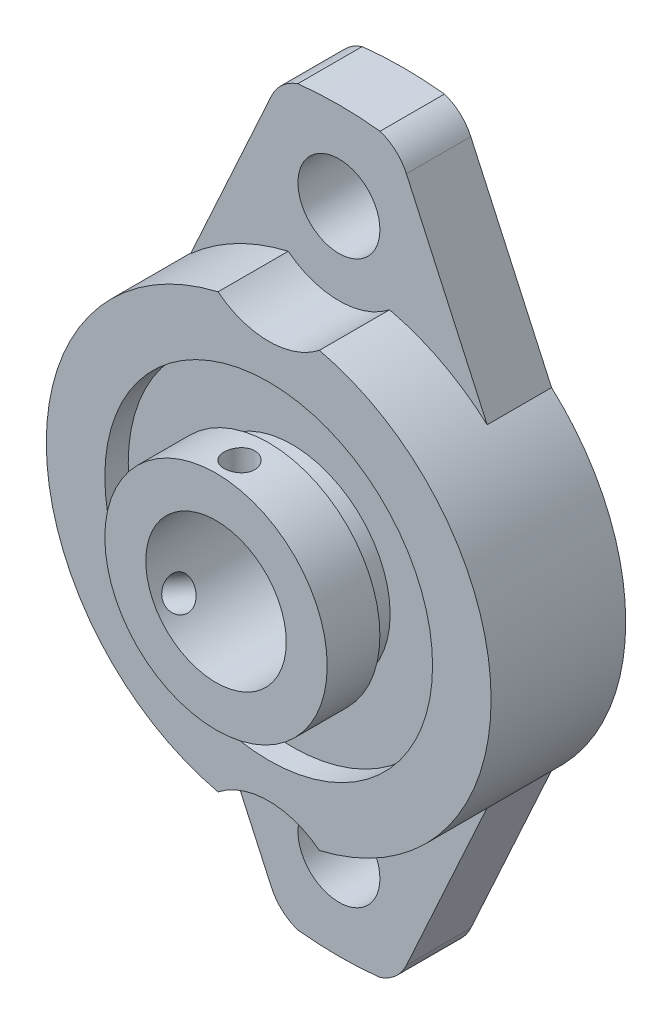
ISO-10303-21;
HEADER;
FILE_DESCRIPTION(('STEP AP214'),'2;1');
FILE_NAME('part.step','',(''),(''),'','','');
FILE_SCHEMA(('AUTOMOTIVE_DESIGN { 1 0 10303 214 1 1 1 1 }'));
ENDSEC;
DATA;
#1=APPLICATION_CONTEXT('core data for automotive mechanical design processes');
#2=APPLICATION_PROTOCOL_DEFINITION('international standard','automotive_design',2000,#1);
#3=PRODUCT_CONTEXT('',#1,'mechanical');
#4=PRODUCT('Part','Part','',(#3));
#5=PRODUCT_RELATED_PRODUCT_CATEGORY('part','',(#4));
#6=PRODUCT_DEFINITION_FORMATION('','',#4);
#7=PRODUCT_DEFINITION_CONTEXT('part definition',#1,'design');
#8=PRODUCT_DEFINITION('design','',#6,#7);
#9=PRODUCT_DEFINITION_SHAPE('','',#8);
#10=(LENGTH_UNIT() NAMED_UNIT(*) SI_UNIT(.MILLI.,.METRE.));
#11=(NAMED_UNIT(*) PLANE_ANGLE_UNIT() SI_UNIT($,.RADIAN.));
#12=(NAMED_UNIT(*) SI_UNIT($,.STERADIAN.) SOLID_ANGLE_UNIT());
#13=UNCERTAINTY_MEASURE_WITH_UNIT(LENGTH_MEASURE(1.E-05),#10,'distance_accuracy_value','');
#14=(GEOMETRIC_REPRESENTATION_CONTEXT(3) GLOBAL_UNCERTAINTY_ASSIGNED_CONTEXT((#13)) GLOBAL_UNIT_ASSIGNED_CONTEXT((#10,
#11,#12)) REPRESENTATION_CONTEXT('',''));
#15=CARTESIAN_POINT('',(0.,0.,0.));
#16=DIRECTION('',(0.,0.,1.));
#17=DIRECTION('',(1.,0.,0.));
#18=AXIS2_PLACEMENT_3D('',#15,#16,#17);
#19=CARTESIAN_POINT('',(0.,14.,11.5));
#20=DIRECTION('',(0.,0.,-1.));
#21=DIRECTION('',(-1.,0.,0.));
#22=AXIS2_PLACEMENT_3D('',#19,#20,#21);
#23=PLANE('',#22);
#24=CARTESIAN_POINT('',(0.,0.,11.5));
#25=DIRECTION('',(0.,0.,1.));
#26=DIRECTION('',(1.,0.,0.));
#27=AXIS2_PLACEMENT_3D('',#24,#25,#26);
#28=CIRCLE('',#27,14.);
#29=CARTESIAN_POINT('',(14.,0.,11.5));
#30=VERTEX_POINT('',#29);
#31=EDGE_CURVE('E170',#30,#30,#28,.T.);
#32=ORIENTED_EDGE('',*,*,#31,.F.);
#33=EDGE_LOOP('',(#32));
#34=FACE_BOUND('',#33,.T.);
#35=CARTESIAN_POINT('',(0.,-24.,11.5));
#36=DIRECTION('',(0.,0.,-1.));
#37=DIRECTION('',(-1.,0.,0.));
#38=AXIS2_PLACEMENT_3D('',#35,#36,#37);
#39=CIRCLE('',#38,7.);
#40=CARTESIAN_POINT('',(4.33012701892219,-18.5,11.5));
#41=VERTEX_POINT('',#40);
#42=CARTESIAN_POINT('',(-4.33012701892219,-18.5,11.5));
#43=VERTEX_POINT('',#42);
#44=EDGE_CURVE('E163',#41,#43,#39,.F.);
#45=ORIENTED_EDGE('',*,*,#44,.F.);
#46=CARTESIAN_POINT('',(0.,0.,11.5));
#47=DIRECTION('',(0.,0.,1.));
#48=DIRECTION('',(1.,0.,0.));
#49=AXIS2_PLACEMENT_3D('',#46,#47,#48);
#50=CIRCLE('',#49,19.);
#51=CARTESIAN_POINT('',(4.33012701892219,18.5,11.5));
#52=VERTEX_POINT('',#51);
#53=EDGE_CURVE('E162',#41,#52,#50,.T.);
#54=ORIENTED_EDGE('',*,*,#53,.T.);
#55=CARTESIAN_POINT('',(0.,24.,11.5));
#56=DIRECTION('',(0.,0.,-1.));
#57=DIRECTION('',(-1.,0.,0.));
#58=AXIS2_PLACEMENT_3D('',#55,#56,#57);
#59=CIRCLE('',#58,7.);
#60=CARTESIAN_POINT('',(-4.33012701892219,18.5,11.5));
#61=VERTEX_POINT('',#60);
#62=EDGE_CURVE('E270',#61,#52,#59,.F.);
#63=ORIENTED_EDGE('',*,*,#62,.F.);
#64=EDGE_CURVE('E213',#61,#43,#50,.T.);
#65=ORIENTED_EDGE('',*,*,#64,.T.);
#66=EDGE_LOOP('',(#45,#54,#63,#65));
#67=FACE_BOUND('',#66,.T.);
#68=ADVANCED_FACE('F35',(#34,#67),#23,.F.);
#69=CARTESIAN_POINT('',(0.,0.,16.));
#70=DIRECTION('',(0.,0.,1.));
#71=DIRECTION('',(1.,0.,0.));
#72=AXIS2_PLACEMENT_3D('',#69,#70,#71);
#73=CYLINDRICAL_SURFACE('',#72,19.);
#74=DIRECTION('',(0.,0.,-1.));
#75=VECTOR('',#74,1.);
#76=CARTESIAN_POINT('',(4.33012701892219,-18.5,10.75));
#77=LINE('',#76,#75);
#78=CARTESIAN_POINT('',(4.33012701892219,-18.5,5.5));
#79=VERTEX_POINT('',#78);
#80=EDGE_CURVE('E149',#79,#41,#77,.F.);
#81=ORIENTED_EDGE('',*,*,#80,.F.);
#82=CARTESIAN_POINT('',(0.,0.,5.5));
#83=DIRECTION('',(0.,0.,1.));
#84=DIRECTION('',(1.,0.,0.));
#85=AXIS2_PLACEMENT_3D('',#82,#83,#84);
#86=CIRCLE('',#85,19.);
#87=CARTESIAN_POINT('',(12.6665,-14.1619129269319,5.5));
#88=VERTEX_POINT('',#87);
#89=EDGE_CURVE('E43',#79,#88,#86,.T.);
#90=ORIENTED_EDGE('',*,*,#89,.T.);
#91=DIRECTION('',(0.,0.,-1.));
#92=VECTOR('',#91,1.);
#93=CARTESIAN_POINT('',(12.6665,-14.1619129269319,79.0730929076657));
#94=LINE('',#93,#92);
#95=CARTESIAN_POINT('',(12.6665,-14.1619129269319,0.));
#96=VERTEX_POINT('',#95);
#97=EDGE_CURVE('E332',#88,#96,#94,.T.);
#98=ORIENTED_EDGE('',*,*,#97,.T.);
#99=CARTESIAN_POINT('',(0.,0.,0.));
#100=DIRECTION('',(0.,0.,1.));
#101=DIRECTION('',(1.,0.,0.));
#102=AXIS2_PLACEMENT_3D('',#99,#100,#101);
#103=CIRCLE('',#102,19.);
#104=CARTESIAN_POINT('',(12.6665,14.1619129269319,0.));
#105=VERTEX_POINT('',#104);
#106=EDGE_CURVE('E216',#96,#105,#103,.T.);
#107=ORIENTED_EDGE('',*,*,#106,.T.);
#108=DIRECTION('',(0.,0.,-1.));
#109=VECTOR('',#108,1.);
#110=CARTESIAN_POINT('',(12.6665,14.1619129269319,79.0730929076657));
#111=LINE('',#110,#109);
#112=CARTESIAN_POINT('',(12.6665,14.1619129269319,5.50000000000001));
#113=VERTEX_POINT('',#112);
#114=EDGE_CURVE('E330',#113,#105,#111,.T.);
#115=ORIENTED_EDGE('',*,*,#114,.F.);
#116=CARTESIAN_POINT('',(4.33012701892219,18.5,5.5));
#117=VERTEX_POINT('',#116);
#118=EDGE_CURVE('E11',#113,#117,#86,.T.);
#119=ORIENTED_EDGE('',*,*,#118,.T.);
#120=DIRECTION('',(0.,0.,-1.));
#121=VECTOR('',#120,1.);
#122=CARTESIAN_POINT('',(4.33012701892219,18.5,10.75));
#123=LINE('',#122,#121);
#124=EDGE_CURVE('E268',#52,#117,#123,.T.);
#125=ORIENTED_EDGE('',*,*,#124,.F.);
#126=ORIENTED_EDGE('',*,*,#53,.F.);
#127=EDGE_LOOP('',(#81,#90,#98,#107,#115,#119,#125,#126));
#128=FACE_BOUND('',#127,.T.);
#129=ADVANCED_FACE('F158',(#128),#73,.T.);
#130=DIRECTION('',(0.,0.,-1.));
#131=VECTOR('',#130,1.);
#132=CARTESIAN_POINT('',(-4.33012701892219,-18.5,10.75));
#133=LINE('',#132,#131);
#134=CARTESIAN_POINT('',(-4.33012701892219,-18.5,5.5));
#135=VERTEX_POINT('',#134);
#136=EDGE_CURVE('E152',#43,#135,#133,.T.);
#137=ORIENTED_EDGE('',*,*,#136,.F.);
#138=ORIENTED_EDGE('',*,*,#64,.F.);
#139=DIRECTION('',(0.,0.,-1.));
#140=VECTOR('',#139,1.);
#141=CARTESIAN_POINT('',(-4.33012701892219,18.5,10.75));
#142=LINE('',#141,#140);
#143=CARTESIAN_POINT('',(-4.33012701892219,18.5,5.5));
#144=VERTEX_POINT('',#143);
#145=EDGE_CURVE('E183',#144,#61,#142,.F.);
#146=ORIENTED_EDGE('',*,*,#145,.F.);
#147=CARTESIAN_POINT('',(-12.6665,14.1619129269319,5.5));
#148=VERTEX_POINT('',#147);
#149=EDGE_CURVE('E42',#144,#148,#86,.T.);
#150=ORIENTED_EDGE('',*,*,#149,.T.);
#151=DIRECTION('',(0.,0.,-1.));
#152=VECTOR('',#151,1.);
#153=CARTESIAN_POINT('',(-12.6665,14.1619129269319,79.0730929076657));
#154=LINE('',#153,#152);
#155=CARTESIAN_POINT('',(-12.6665,14.1619129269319,0.));
#156=VERTEX_POINT('',#155);
#157=EDGE_CURVE('E180',#148,#156,#154,.T.);
#158=ORIENTED_EDGE('',*,*,#157,.T.);
#159=CARTESIAN_POINT('',(-12.6665,-14.1619129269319,0.));
#160=VERTEX_POINT('',#159);
#161=EDGE_CURVE('E219',#156,#160,#103,.T.);
#162=ORIENTED_EDGE('',*,*,#161,.T.);
#163=DIRECTION('',(0.,0.,-1.));
#164=VECTOR('',#163,1.);
#165=CARTESIAN_POINT('',(-12.6665,-14.1619129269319,79.0730929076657));
#166=LINE('',#165,#164);
#167=CARTESIAN_POINT('',(-12.6665,-14.1619129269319,5.50000000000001));
#168=VERTEX_POINT('',#167);
#169=EDGE_CURVE('E198',#168,#160,#166,.T.);
#170=ORIENTED_EDGE('',*,*,#169,.F.);
#171=EDGE_CURVE('E44',#168,#135,#86,.T.);
#172=ORIENTED_EDGE('',*,*,#171,.T.);
#173=EDGE_LOOP('',(#137,#138,#146,#150,#158,#162,#170,#172));
#174=FACE_BOUND('',#173,.T.);
#175=ADVANCED_FACE('F177',(#174),#73,.T.);
#176=CARTESIAN_POINT('',(0.,0.,16.));
#177=DIRECTION('',(0.,0.,1.));
#178=DIRECTION('',(1.,0.,0.));
#179=AXIS2_PLACEMENT_3D('',#176,#177,#178);
#180=CYLINDRICAL_SURFACE('',#179,14.);
#181=CARTESIAN_POINT('',(0.,0.,9.5));
#182=DIRECTION('',(0.,0.,1.));
#183=DIRECTION('',(1.,0.,0.));
#184=AXIS2_PLACEMENT_3D('',#181,#182,#183);
#185=CIRCLE('',#184,14.);
#186=CARTESIAN_POINT('',(14.,0.,9.5));
#187=VERTEX_POINT('',#186);
#188=EDGE_CURVE('E172',#187,#187,#185,.T.);
#189=ORIENTED_EDGE('',*,*,#188,.F.);
#190=EDGE_LOOP('',(#189));
#191=FACE_BOUND('',#190,.T.);
#192=ORIENTED_EDGE('',*,*,#31,.T.);
#193=EDGE_LOOP('',(#192));
#194=FACE_BOUND('',#193,.T.);
#195=ADVANCED_FACE('F255',(#191,#194),#180,.F.);
#196=CARTESIAN_POINT('',(0.,8.375,9.5));
#197=DIRECTION('',(0.,0.,-1.));
#198=DIRECTION('',(-1.,0.,0.));
#199=AXIS2_PLACEMENT_3D('',#196,#197,#198);
#200=PLANE('',#199);
#201=CARTESIAN_POINT('',(0.,0.,9.5));
#202=DIRECTION('',(0.,0.,1.));
#203=DIRECTION('',(1.,0.,0.));
#204=AXIS2_PLACEMENT_3D('',#201,#202,#203);
#205=CIRCLE('',#204,8.375);
#206=CARTESIAN_POINT('',(8.375,0.,9.5));
#207=VERTEX_POINT('',#206);
#208=EDGE_CURVE('E247',#207,#207,#205,.T.);
#209=ORIENTED_EDGE('',*,*,#208,.F.);
#210=EDGE_LOOP('',(#209));
#211=FACE_BOUND('',#210,.T.);
#212=ORIENTED_EDGE('',*,*,#188,.T.);
#213=EDGE_LOOP('',(#212));
#214=FACE_BOUND('',#213,.T.);
#215=ADVANCED_FACE('F253',(#211,#214),#200,.F.);
#216=CARTESIAN_POINT('',(0.,0.,16.));
#217=DIRECTION('',(0.,0.,1.));
#218=DIRECTION('',(1.,0.,0.));
#219=AXIS2_PLACEMENT_3D('',#216,#217,#218);
#220=CYLINDRICAL_SURFACE('',#219,8.375);
#221=CARTESIAN_POINT('',(0.,0.,11.5));
#222=DIRECTION('',(0.,0.,1.));
#223=DIRECTION('',(1.,0.,0.));
#224=AXIS2_PLACEMENT_3D('',#221,#222,#223);
#225=CIRCLE('',#224,8.375);
#226=CARTESIAN_POINT('',(8.375,0.,11.5));
#227=VERTEX_POINT('',#226);
#228=EDGE_CURVE('E244',#227,#227,#225,.T.);
#229=ORIENTED_EDGE('',*,*,#228,.F.);
#230=EDGE_LOOP('',(#229));
#231=FACE_BOUND('',#230,.T.);
#232=ORIENTED_EDGE('',*,*,#208,.T.);
#233=EDGE_LOOP('',(#232));
#234=FACE_BOUND('',#233,.T.);
#235=ADVANCED_FACE('F674',(#231,#234),#220,.T.);
#236=CARTESIAN_POINT('',(0.,9.5,11.5));
#237=DIRECTION('',(0.,0.,1.));
#238=DIRECTION('',(1.,0.,0.));
#239=AXIS2_PLACEMENT_3D('',#236,#237,#238);
#240=PLANE('',#239);
#241=CARTESIAN_POINT('',(0.,0.,11.5));
#242=DIRECTION('',(0.,0.,1.));
#243=DIRECTION('',(1.,0.,0.));
#244=AXIS2_PLACEMENT_3D('',#241,#242,#243);
#245=CIRCLE('',#244,9.5);
#246=CARTESIAN_POINT('',(9.5,0.,11.5));
#247=VERTEX_POINT('',#246);
#248=EDGE_CURVE('E241',#247,#247,#245,.T.);
#249=ORIENTED_EDGE('',*,*,#248,.F.);
#250=EDGE_LOOP('',(#249));
#251=FACE_BOUND('',#250,.T.);
#252=ORIENTED_EDGE('',*,*,#228,.T.);
#253=EDGE_LOOP('',(#252));
#254=FACE_BOUND('',#253,.T.);
#255=ADVANCED_FACE('F436',(#251,#254),#240,.F.);
#256=CARTESIAN_POINT('',(0.,0.,16.));
#257=DIRECTION('',(0.,0.,1.));
#258=DIRECTION('',(1.,0.,0.));
#259=AXIS2_PLACEMENT_3D('',#256,#257,#258);
#260=CYLINDRICAL_SURFACE('',#259,9.5);
#261=CARTESIAN_POINT('',(-7.49333529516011,-5.83951420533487,14.));
#262=CARTESIAN_POINT('',(-7.49333782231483,-5.83951211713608,13.926765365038));
#263=CARTESIAN_POINT('',(-7.49716355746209,-5.83461197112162,13.8534865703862));
#264=CARTESIAN_POINT('',(-7.51230091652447,-5.81510803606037,13.7089730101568));
#265=CARTESIAN_POINT('',(-7.52362010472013,-5.80049444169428,13.6377403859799));
#266=CARTESIAN_POINT('',(-7.55321785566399,-5.76189964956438,13.4994321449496));
#267=CARTESIAN_POINT('',(-7.57149138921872,-5.73792522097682,13.4323535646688));
#268=CARTESIAN_POINT('',(-7.61418850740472,-5.68114330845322,13.3041767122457));
#269=CARTESIAN_POINT('',(-7.63861114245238,-5.64833718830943,13.2430775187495));
#270=CARTESIAN_POINT('',(-7.69274533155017,-5.57438568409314,13.1281680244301));
#271=CARTESIAN_POINT('',(-7.72248807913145,-5.53319090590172,13.0744042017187));
#272=CARTESIAN_POINT('',(-7.785960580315,-5.44351261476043,12.976093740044));
#273=CARTESIAN_POINT('',(-7.81969054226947,-5.3950287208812,12.9315475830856));
#274=CARTESIAN_POINT('',(-7.88998564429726,-5.2916954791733,12.8527677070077));
#275=CARTESIAN_POINT('',(-7.92656170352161,-5.23682116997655,12.8185764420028));
#276=CARTESIAN_POINT('',(-8.00108638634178,-5.12223411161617,12.7617490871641));
#277=CARTESIAN_POINT('',(-8.03903494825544,-5.06252157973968,12.7391124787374));
#278=CARTESIAN_POINT('',(-8.11475507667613,-4.94023144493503,12.7061769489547));
#279=CARTESIAN_POINT('',(-8.15252623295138,-4.87767449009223,12.6958004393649));
#280=CARTESIAN_POINT('',(-8.22694362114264,-4.75108281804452,12.6874389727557));
#281=CARTESIAN_POINT('',(-8.26358990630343,-4.68704817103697,12.6894534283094));
#282=CARTESIAN_POINT('',(-8.33448042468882,-4.55979245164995,12.7057550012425));
#283=CARTESIAN_POINT('',(-8.36873928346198,-4.49656880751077,12.7199586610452));
#284=CARTESIAN_POINT('',(-8.43430097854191,-4.37235660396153,12.7601047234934));
#285=CARTESIAN_POINT('',(-8.46560374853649,-4.31136809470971,12.7860473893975));
#286=CARTESIAN_POINT('',(-8.52472165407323,-4.19326845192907,12.8490221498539));
#287=CARTESIAN_POINT('',(-8.55252517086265,-4.13617051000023,12.8860898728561));
#288=CARTESIAN_POINT('',(-8.60408377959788,-4.02782173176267,12.9702365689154));
#289=CARTESIAN_POINT('',(-8.62783864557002,-3.97657122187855,13.0173161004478));
#290=CARTESIAN_POINT('',(-8.67119290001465,-3.88113250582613,13.1206162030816));
#291=CARTESIAN_POINT('',(-8.69075606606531,-3.83700661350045,13.176909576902));
#292=CARTESIAN_POINT('',(-8.72530050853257,-3.75779248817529,13.2967906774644));
#293=CARTESIAN_POINT('',(-8.74028176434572,-3.72270429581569,13.3603784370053));
#294=CARTESIAN_POINT('',(-8.76557644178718,-3.6627495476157,13.4931128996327));
#295=CARTESIAN_POINT('',(-8.77588711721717,-3.63788900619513,13.5622628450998));
#296=CARTESIAN_POINT('',(-8.79178120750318,-3.59930863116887,13.7041217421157));
#297=CARTESIAN_POINT('',(-8.79736490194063,-3.58558813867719,13.7768304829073));
#298=CARTESIAN_POINT('',(-8.80376081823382,-3.56985547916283,13.9231041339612));
#299=CARTESIAN_POINT('',(-8.80461182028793,-3.56774815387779,13.9966571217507));
#300=CARTESIAN_POINT('',(-8.80164402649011,-3.57506327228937,14.1430907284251));
#301=CARTESIAN_POINT('',(-8.79782535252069,-3.58448541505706,14.2159713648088));
#302=CARTESIAN_POINT('',(-8.78555603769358,-3.61445193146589,14.3586812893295));
#303=CARTESIAN_POINT('',(-8.77712477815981,-3.63494976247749,14.4285220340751));
#304=CARTESIAN_POINT('',(-8.75567576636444,-3.68631413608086,14.5635294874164));
#305=CARTESIAN_POINT('',(-8.74265782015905,-3.71718111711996,14.6286959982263));
#306=CARTESIAN_POINT('',(-8.71200640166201,-3.78846321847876,14.7529636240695));
#307=CARTESIAN_POINT('',(-8.69434392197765,-3.82893818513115,14.8120232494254));
#308=CARTESIAN_POINT('',(-8.65457782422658,-3.91799115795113,14.9219757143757));
#309=CARTESIAN_POINT('',(-8.63247399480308,-3.96656954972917,14.9728681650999));
#310=CARTESIAN_POINT('',(-8.58389125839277,-4.07064187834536,15.0654031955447));
#311=CARTESIAN_POINT('',(-8.55738283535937,-4.12618180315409,15.1069785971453));
#312=CARTESIAN_POINT('',(-8.50048969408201,-4.24215045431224,15.17923294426));
#313=CARTESIAN_POINT('',(-8.47010506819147,-4.30257906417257,15.2099121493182));
#314=CARTESIAN_POINT('',(-8.40613577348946,-4.42625219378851,15.2593940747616));
#315=CARTESIAN_POINT('',(-8.37256168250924,-4.48948705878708,15.2782345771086));
#316=CARTESIAN_POINT('',(-8.30290771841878,-4.61703369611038,15.3036268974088));
#317=CARTESIAN_POINT('',(-8.26682798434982,-4.68134540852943,15.3101793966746));
#318=CARTESIAN_POINT('',(-8.19344678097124,-4.80861534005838,15.3107950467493));
#319=CARTESIAN_POINT('',(-8.15615793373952,-4.87158036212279,15.3049613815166));
#320=CARTESIAN_POINT('',(-8.0811973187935,-4.99494356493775,15.2811901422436));
#321=CARTESIAN_POINT('',(-8.04352555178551,-5.05534175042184,15.2632525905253));
#322=CARTESIAN_POINT('',(-7.96905420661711,-5.1719398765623,15.2158172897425));
#323=CARTESIAN_POINT('',(-7.93225418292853,-5.22814199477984,15.1863255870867));
#324=CARTESIAN_POINT('',(-7.86079252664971,-5.33498612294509,15.1166299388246));
#325=CARTESIAN_POINT('',(-7.82613094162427,-5.38562800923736,15.0764257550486));
#326=CARTESIAN_POINT('',(-7.75996465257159,-5.48054079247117,14.9860687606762));
#327=CARTESIAN_POINT('',(-7.7284872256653,-5.52475786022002,14.9358394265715));
#328=CARTESIAN_POINT('',(-7.67024467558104,-5.60533898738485,14.8270184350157));
#329=CARTESIAN_POINT('',(-7.64348066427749,-5.6417011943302,14.7684248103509));
#330=CARTESIAN_POINT('',(-7.59567707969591,-5.70590081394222,14.6442171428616));
#331=CARTESIAN_POINT('',(-7.57466507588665,-5.73369724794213,14.5785713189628));
#332=CARTESIAN_POINT('',(-7.53948196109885,-5.77988427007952,14.442378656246));
#333=CARTESIAN_POINT('',(-7.52530357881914,-5.79828485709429,14.3718371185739));
#334=CARTESIAN_POINT('',(-7.50773374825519,-5.82100188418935,14.2507946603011));
#335=CARTESIAN_POINT('',(-7.50234614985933,-5.82793591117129,14.2010497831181));
#336=CARTESIAN_POINT('',(-7.49514607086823,-5.83719276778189,14.1008769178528));
#337=CARTESIAN_POINT('',(-7.49333355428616,-5.83951564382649,14.0504489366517));
#338=CARTESIAN_POINT('',(-7.49333529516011,-5.83951420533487,14.));
#339=B_SPLINE_CURVE_WITH_KNOTS('',3,(#261,#262,#263,#264,#265,#266,#267,#268,#269,#270,#271,
#272,#273,#274,#275,#276,#277,#278,#279,#280,#281,#282,#283,#284,#285,#286,#287,#288,#289,#290,
#291,#292,#293,#294,#295,#296,#297,#298,#299,#300,#301,#302,#303,#304,#305,#306,#307,#308,#309,
#310,#311,#312,#313,#314,#315,#316,#317,#318,#319,#320,#321,#322,#323,#324,#325,#326,#327,#328,
#329,#330,#331,#332,#333,#334,#335,#336,#337,#338),.UNSPECIFIED.,.T.,.F.,(4,2,2,2,2,2,2,2,2,2,2,
2,2,2,2,2,2,2,2,2,2,2,2,2,2,2,2,2,2,2,2,2,2,2,2,2,2,2,4),(0.,0.219519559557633,
0.439261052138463,0.658843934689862,0.878392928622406,1.09927412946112,1.32016687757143,
1.54195337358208,1.76372991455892,1.98409529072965,2.20445021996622,2.42330834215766,
2.64217137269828,2.86174293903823,3.08132675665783,3.30273772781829,3.52414969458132,
3.74569167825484,3.96722055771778,4.18693150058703,4.40663670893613,4.62542576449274,
4.84422407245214,5.06442275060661,5.28463191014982,5.50638110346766,5.72812501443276,
5.94915761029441,6.17017795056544,6.38936429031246,6.60855022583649,6.827621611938,
7.04669786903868,7.26751514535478,7.48838444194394,7.71029453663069,7.93196798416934,
8.08318932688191,8.23440914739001),.UNSPECIFIED.);
#340=CARTESIAN_POINT('',(-7.49333529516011,-5.83951420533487,14.));
#341=VERTEX_POINT('',#340);
#342=EDGE_CURVE('E446',#341,#341,#339,.T.);
#343=ORIENTED_EDGE('',*,*,#342,.T.);
#344=EDGE_LOOP('',(#343));
#345=FACE_BOUND('',#344,.T.);
#346=CARTESIAN_POINT('',(0.,9.5,15.3105));
#347=CARTESIAN_POINT('',(-0.0732383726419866,9.49999889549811,15.3104969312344));
#348=CARTESIAN_POINT('',(-0.14652089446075,9.49914416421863,15.304339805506));
#349=CARTESIAN_POINT('',(-0.291042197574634,9.49581670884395,15.279877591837));
#350=CARTESIAN_POINT('',(-0.362278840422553,9.49334235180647,15.2615602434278));
#351=CARTESIAN_POINT('',(-0.500595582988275,9.48705405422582,15.2133314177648));
#352=CARTESIAN_POINT('',(-0.567678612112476,9.48324107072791,15.1834282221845));
#353=CARTESIAN_POINT('',(-0.695862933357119,9.47469823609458,15.1128957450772));
#354=CARTESIAN_POINT('',(-0.756965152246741,9.46996852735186,15.0722681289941));
#355=CARTESIAN_POINT('',(-0.87187129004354,9.4600840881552,14.9811517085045));
#356=CARTESIAN_POINT('',(-0.925629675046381,9.454926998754,14.9306057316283));
#357=CARTESIAN_POINT('',(-1.02392962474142,9.44478777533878,14.8212103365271));
#358=CARTESIAN_POINT('',(-1.06847069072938,9.43980565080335,14.7623604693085));
#359=CARTESIAN_POINT('',(-1.14724519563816,9.43055744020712,14.6377267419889));
#360=CARTESIAN_POINT('',(-1.18143525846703,9.42629439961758,14.5719152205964));
#361=CARTESIAN_POINT('',(-1.23826013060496,9.41899875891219,14.4354155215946));
#362=CARTESIAN_POINT('',(-1.2608954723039,9.41596610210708,14.3647275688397));
#363=CARTESIAN_POINT('',(-1.29382842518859,9.41149750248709,14.2209575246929));
#364=CARTESIAN_POINT('',(-1.30420349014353,9.4100515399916,14.1478934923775));
#365=CARTESIAN_POINT('',(-1.31256118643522,9.40888952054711,14.0010481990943));
#366=CARTESIAN_POINT('',(-1.31054442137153,9.4091733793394,13.9272669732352));
#367=CARTESIAN_POINT('',(-1.29423914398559,9.41142976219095,13.781625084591));
#368=CARTESIAN_POINT('',(-1.28003641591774,9.4133904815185,13.7097546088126));
#369=CARTESIAN_POINT('',(-1.23989643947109,9.41876123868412,13.5694268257));
#370=CARTESIAN_POINT('',(-1.21395890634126,9.42217131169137,13.5009696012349));
#371=CARTESIAN_POINT('',(-1.15099487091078,9.4300697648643,13.3691477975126));
#372=CARTESIAN_POINT('',(-1.11393155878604,9.43456171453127,13.3058010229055));
#373=CARTESIAN_POINT('',(-1.02979432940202,9.44411512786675,13.1861935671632));
#374=CARTESIAN_POINT('',(-0.982719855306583,9.44917662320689,13.1299332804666));
#375=CARTESIAN_POINT('',(-0.879423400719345,9.45935115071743,13.0255982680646));
#376=CARTESIAN_POINT('',(-0.823127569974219,9.46446425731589,12.9775966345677));
#377=CARTESIAN_POINT('',(-0.703239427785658,9.47412607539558,12.8917122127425));
#378=CARTESIAN_POINT('',(-0.639647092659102,9.47867478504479,12.8538294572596));
#379=CARTESIAN_POINT('',(-0.506911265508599,9.48669902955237,12.789256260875));
#380=CARTESIAN_POINT('',(-0.437765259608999,9.49017407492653,12.7625709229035));
#381=CARTESIAN_POINT('',(-0.295914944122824,9.49565520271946,12.7212108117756));
#382=CARTESIAN_POINT('',(-0.223210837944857,9.49766136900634,12.7065353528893));
#383=CARTESIAN_POINT('',(-0.0769395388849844,9.49996769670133,12.6897075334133));
#384=CARTESIAN_POINT('',(-0.00338412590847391,9.500281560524,12.6874545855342));
#385=CARTESIAN_POINT('',(0.143054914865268,9.4992050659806,12.6952695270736));
#386=CARTESIAN_POINT('',(0.215938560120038,9.49781475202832,12.7053370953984));
#387=CARTESIAN_POINT('',(0.358664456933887,9.49349461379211,12.7374236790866));
#388=CARTESIAN_POINT('',(0.428517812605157,9.49057103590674,12.7593942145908));
#389=CARTESIAN_POINT('',(0.563549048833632,9.48351137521,12.814612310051));
#390=CARTESIAN_POINT('',(0.628726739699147,9.4793752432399,12.8478603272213));
#391=CARTESIAN_POINT('',(0.753002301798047,9.47031670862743,12.9249292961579));
#392=CARTESIAN_POINT('',(0.812059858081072,9.46538957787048,12.9688146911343));
#393=CARTESIAN_POINT('',(0.922007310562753,9.45531366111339,13.0658222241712));
#394=CARTESIAN_POINT('',(0.972896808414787,9.4501648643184,13.1189448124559));
#395=CARTESIAN_POINT('',(1.06542500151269,9.44018305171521,13.2333642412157));
#396=CARTESIAN_POINT('',(1.1069966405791,9.43535249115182,13.294715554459));
#397=CARTESIAN_POINT('',(1.17924439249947,9.4265960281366,13.4235891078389));
#398=CARTESIAN_POINT('',(1.20992076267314,9.42267010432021,13.4911112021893));
#399=CARTESIAN_POINT('',(1.25940090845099,9.41618470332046,13.6302014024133));
#400=CARTESIAN_POINT('',(1.27824123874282,9.41362102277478,13.7017562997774));
#401=CARTESIAN_POINT('',(1.30363157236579,9.41013877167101,13.8470521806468));
#402=CARTESIAN_POINT('',(1.31018228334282,9.4092201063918,13.9207930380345));
#403=CARTESIAN_POINT('',(1.31079252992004,9.40913505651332,14.0676999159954));
#404=CARTESIAN_POINT('',(1.30495744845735,9.40995388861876,14.1408655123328));
#405=CARTESIAN_POINT('',(1.28118623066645,9.41321961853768,14.2851648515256));
#406=CARTESIAN_POINT('',(1.26325010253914,9.41566651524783,14.356298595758));
#407=CARTESIAN_POINT('',(1.21582106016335,9.42190780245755,14.4944934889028));
#408=CARTESIAN_POINT('',(1.18633436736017,9.42570146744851,14.5615568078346));
#409=CARTESIAN_POINT('',(1.11665158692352,9.43420987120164,14.6898011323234));
#410=CARTESIAN_POINT('',(1.07645525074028,9.43892463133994,14.7509820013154));
#411=CARTESIAN_POINT('',(0.986107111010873,9.44879192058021,14.8662619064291));
#412=CARTESIAN_POINT('',(0.935876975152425,9.45394769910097,14.9202992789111));
#413=CARTESIAN_POINT('',(0.827052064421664,9.46408817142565,15.0192166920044));
#414=CARTESIAN_POINT('',(0.768455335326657,9.46907282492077,15.0640945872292));
#415=CARTESIAN_POINT('',(0.644244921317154,9.4783353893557,15.1436008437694));
#416=CARTESIAN_POINT('',(0.578600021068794,9.4826099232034,15.1781808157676));
#417=CARTESIAN_POINT('',(0.44240926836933,9.48993708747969,15.2357746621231));
#418=CARTESIAN_POINT('',(0.371868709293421,9.49299101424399,15.2588008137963));
#419=CARTESIAN_POINT('',(0.25082205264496,9.49681593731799,15.2872635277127));
#420=CARTESIAN_POINT('',(0.201071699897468,9.49800398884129,15.2959642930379));
#421=CARTESIAN_POINT('',(0.100887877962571,9.49959639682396,15.3075835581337));
#422=CARTESIAN_POINT('',(0.0504544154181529,9.5000007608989,15.3105021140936));
#423=CARTESIAN_POINT('',(0.,9.5,15.3105));
#424=B_SPLINE_CURVE_WITH_KNOTS('',3,(#346,#347,#348,#349,#350,#351,#352,#353,#354,#355,#356,
#357,#358,#359,#360,#361,#362,#363,#364,#365,#366,#367,#368,#369,#370,#371,#372,#373,#374,#375,
#376,#377,#378,#379,#380,#381,#382,#383,#384,#385,#386,#387,#388,#389,#390,#391,#392,#393,#394,
#395,#396,#397,#398,#399,#400,#401,#402,#403,#404,#405,#406,#407,#408,#409,#410,#411,#412,#413,
#414,#415,#416,#417,#418,#419,#420,#421,#422,#423),.UNSPECIFIED.,.T.,.F.,(4,2,2,2,2,2,2,2,2,2,2,
2,2,2,2,2,2,2,2,2,2,2,2,2,2,2,2,2,2,2,2,2,2,2,2,2,2,2,4),(0.,0.219530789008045,
0.439283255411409,0.658878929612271,0.878440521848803,1.09930702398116,1.32018547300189,
1.54197709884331,1.76375850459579,1.98413119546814,2.20449315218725,2.42331645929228,
2.64214507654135,2.86170582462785,3.08127878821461,3.30270491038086,3.52413175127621,
3.74565939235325,3.96717438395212,4.18689306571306,4.40660602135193,4.62543075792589,
4.84426436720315,5.06445838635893,5.28466314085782,5.506405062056,5.72814174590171,
5.94919020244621,6.17022593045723,6.38938854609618,6.60855101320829,6.82759559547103,
7.04664526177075,7.26747700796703,7.4883604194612,7.7102659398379,7.93193515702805,
8.08317288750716,8.23440914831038),.UNSPECIFIED.);
#425=CARTESIAN_POINT('',(0.,9.5,15.3105));
#426=VERTEX_POINT('',#425);
#427=EDGE_CURVE('E154',#426,#426,#424,.T.);
#428=ORIENTED_EDGE('',*,*,#427,.T.);
#429=EDGE_LOOP('',(#428));
#430=FACE_BOUND('',#429,.T.);
#431=CARTESIAN_POINT('',(0.,0.,16.));
#432=DIRECTION('',(0.,0.,1.));
#433=DIRECTION('',(1.,0.,0.));
#434=AXIS2_PLACEMENT_3D('',#431,#432,#433);
#435=CIRCLE('',#434,9.5);
#436=CARTESIAN_POINT('',(9.5,0.,16.));
#437=VERTEX_POINT('',#436);
#438=EDGE_CURVE('E238',#437,#437,#435,.T.);
#439=ORIENTED_EDGE('',*,*,#438,.F.);
#440=EDGE_LOOP('',(#439));
#441=FACE_BOUND('',#440,.T.);
#442=ORIENTED_EDGE('',*,*,#248,.T.);
#443=EDGE_LOOP('',(#442));
#444=FACE_BOUND('',#443,.T.);
#445=ADVANCED_FACE('F431',(#345,#430,#441,#444),#260,.T.);
#446=CARTESIAN_POINT('',(0.,6.,16.));
#447=DIRECTION('',(0.,0.,-1.));
#448=DIRECTION('',(-1.,0.,0.));
#449=AXIS2_PLACEMENT_3D('',#446,#447,#448);
#450=PLANE('',#449);
#451=CARTESIAN_POINT('',(0.,0.,16.));
#452=DIRECTION('',(0.,0.,1.));
#453=DIRECTION('',(1.,0.,0.));
#454=AXIS2_PLACEMENT_3D('',#451,#452,#453);
#455=CIRCLE('',#454,6.);
#456=CARTESIAN_POINT('',(6.,0.,16.));
#457=VERTEX_POINT('',#456);
#458=EDGE_CURVE('E235',#457,#457,#455,.T.);
#459=ORIENTED_EDGE('',*,*,#458,.F.);
#460=EDGE_LOOP('',(#459));
#461=FACE_BOUND('',#460,.T.);
#462=ORIENTED_EDGE('',*,*,#438,.T.);
#463=EDGE_LOOP('',(#462));
#464=FACE_BOUND('',#463,.T.);
#465=ADVANCED_FACE('F427',(#461,#464),#450,.F.);
#466=CARTESIAN_POINT('',(0.,0.,16.));
#467=DIRECTION('',(0.,0.,1.));
#468=DIRECTION('',(1.,0.,0.));
#469=AXIS2_PLACEMENT_3D('',#466,#467,#468);
#470=CYLINDRICAL_SURFACE('',#469,6.);
#471=CARTESIAN_POINT('',(-4.41544446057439,-4.0624931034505,14.));
#472=CARTESIAN_POINT('',(-4.41544698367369,-4.06249167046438,14.0726630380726));
#473=CARTESIAN_POINT('',(-4.41966061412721,-4.05792525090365,14.1453561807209));
#474=CARTESIAN_POINT('',(-4.43628536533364,-4.03974236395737,14.288675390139));
#475=CARTESIAN_POINT('',(-4.44870242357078,-4.02611934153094,14.3592999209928));
#476=CARTESIAN_POINT('',(-4.48103243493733,-3.99010391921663,14.4963879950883));
#477=CARTESIAN_POINT('',(-4.50093717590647,-3.96772112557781,14.5628560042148));
#478=CARTESIAN_POINT('',(-4.54721598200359,-3.91459607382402,14.6899282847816));
#479=CARTESIAN_POINT('',(-4.57358990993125,-3.88385399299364,14.7505326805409));
#480=CARTESIAN_POINT('',(-4.63199235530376,-3.81401944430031,14.865179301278));
#481=CARTESIAN_POINT('',(-4.66410038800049,-3.77480767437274,14.919108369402));
#482=CARTESIAN_POINT('',(-4.73223673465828,-3.68902838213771,15.0178825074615));
#483=CARTESIAN_POINT('',(-4.76826535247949,-3.64246028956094,15.0627268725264));
#484=CARTESIAN_POINT('',(-4.84310831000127,-3.54234984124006,15.1425060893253));
#485=CARTESIAN_POINT('',(-4.88194789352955,-3.4887394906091,15.177332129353));
#486=CARTESIAN_POINT('',(-4.96048571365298,-3.37613492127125,15.2353821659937));
#487=CARTESIAN_POINT('',(-5.00018385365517,-3.31714130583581,15.2586074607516));
#488=CARTESIAN_POINT('',(-5.07831085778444,-3.19622538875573,15.2924408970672));
#489=CARTESIAN_POINT('',(-5.11674986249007,-3.13436326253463,15.3032405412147));
#490=CARTESIAN_POINT('',(-5.19170138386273,-3.00858659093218,15.3125148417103));
#491=CARTESIAN_POINT('',(-5.22821411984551,-2.94467228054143,15.3109909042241));
#492=CARTESIAN_POINT('',(-5.29766686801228,-2.8177777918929,15.2958039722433));
#493=CARTESIAN_POINT('',(-5.33065698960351,-2.75480016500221,15.2823473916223));
#494=CARTESIAN_POINT('',(-5.39304453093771,-2.63057128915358,15.244006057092));
#495=CARTESIAN_POINT('',(-5.42244178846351,-2.5693201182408,15.2191207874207));
#496=CARTESIAN_POINT('',(-5.47740927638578,-2.44996738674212,15.1584457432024));
#497=CARTESIAN_POINT('',(-5.50294999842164,-2.39189208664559,15.1225776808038));
#498=CARTESIAN_POINT('',(-5.54976262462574,-2.28117368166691,15.0410135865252));
#499=CARTESIAN_POINT('',(-5.57103394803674,-2.22853131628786,14.9953162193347));
#500=CARTESIAN_POINT('',(-5.60970834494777,-2.12933549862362,14.8942667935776));
#501=CARTESIAN_POINT('',(-5.62702199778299,-2.08293104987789,14.8387340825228));
#502=CARTESIAN_POINT('',(-5.65733197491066,-1.99914629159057,14.7201809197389));
#503=CARTESIAN_POINT('',(-5.67032818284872,-1.96176622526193,14.6571602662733));
#504=CARTESIAN_POINT('',(-5.69221239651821,-1.89733621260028,14.5251397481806));
#505=CARTESIAN_POINT('',(-5.70108818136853,-1.87031703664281,14.4561228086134));
#506=CARTESIAN_POINT('',(-5.7148376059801,-1.82787690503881,14.3142333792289));
#507=CARTESIAN_POINT('',(-5.71971187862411,-1.81245411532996,14.2413615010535));
#508=CARTESIAN_POINT('',(-5.72550681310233,-1.79406347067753,14.0954181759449));
#509=CARTESIAN_POINT('',(-5.7265058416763,-1.7908487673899,14.0223809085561));
#510=CARTESIAN_POINT('',(-5.72478907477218,-1.79632905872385,13.8768025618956));
#511=CARTESIAN_POINT('',(-5.72207353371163,-1.8050232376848,13.8042614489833));
#512=CARTESIAN_POINT('',(-5.71292335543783,-1.83377412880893,13.6626148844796));
#513=CARTESIAN_POINT('',(-5.70653296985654,-1.85369558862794,13.5934789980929));
#514=CARTESIAN_POINT('',(-5.68994387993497,-1.90400522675,13.4596145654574));
#515=CARTESIAN_POINT('',(-5.67974481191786,-1.93439440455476,13.3948864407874));
#516=CARTESIAN_POINT('',(-5.65519043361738,-2.00505265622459,13.270580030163));
#517=CARTESIAN_POINT('',(-5.64077371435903,-2.04546625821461,13.2110960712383));
#518=CARTESIAN_POINT('',(-5.60768802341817,-2.13449887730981,13.0999624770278));
#519=CARTESIAN_POINT('',(-5.58901852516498,-2.1831189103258,13.048313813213));
#520=CARTESIAN_POINT('',(-5.54694921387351,-2.2879238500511,12.9533354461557));
#521=CARTESIAN_POINT('',(-5.52346794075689,-2.34423255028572,12.9101781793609));
#522=CARTESIAN_POINT('',(-5.47206368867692,-2.46183488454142,12.8346406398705));
#523=CARTESIAN_POINT('',(-5.44414091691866,-2.52312828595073,12.8022598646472));
#524=CARTESIAN_POINT('',(-5.38435133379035,-2.64830824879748,12.7494348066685));
#525=CARTESIAN_POINT('',(-5.35251106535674,-2.7121755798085,12.7289150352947));
#526=CARTESIAN_POINT('',(-5.28534903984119,-2.84083552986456,12.700158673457));
#527=CARTESIAN_POINT('',(-5.2500277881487,-2.90562801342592,12.6919203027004));
#528=CARTESIAN_POINT('',(-5.177583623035,-3.03279960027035,12.6880404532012));
#529=CARTESIAN_POINT('',(-5.14051320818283,-3.09520089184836,12.6921414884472));
#530=CARTESIAN_POINT('',(-5.06504404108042,-3.21721554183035,12.7122482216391));
#531=CARTESIAN_POINT('',(-5.02664531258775,-3.2768289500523,12.7282537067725));
#532=CARTESIAN_POINT('',(-4.94996306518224,-3.39155056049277,12.7715917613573));
#533=CARTESIAN_POINT('',(-4.91167957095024,-3.44667257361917,12.7988879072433));
#534=CARTESIAN_POINT('',(-4.83651296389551,-3.55138017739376,12.8639968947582));
#535=CARTESIAN_POINT('',(-4.79962998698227,-3.60096523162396,12.9018107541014));
#536=CARTESIAN_POINT('',(-4.72803664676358,-3.6944833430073,12.9877218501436));
#537=CARTESIAN_POINT('',(-4.69338063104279,-3.73829163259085,13.0360002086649));
#538=CARTESIAN_POINT('',(-4.62851270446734,-3.81831505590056,13.1411044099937));
#539=CARTESIAN_POINT('',(-4.59830186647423,-3.85452835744,13.1979323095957));
#540=CARTESIAN_POINT('',(-4.54337203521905,-3.91913221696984,13.3194330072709));
#541=CARTESIAN_POINT('',(-4.51873158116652,-3.94741211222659,13.3842002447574));
#542=CARTESIAN_POINT('',(-4.47675894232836,-3.99495216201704,13.5191450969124));
#543=CARTESIAN_POINT('',(-4.45942056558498,-4.01421996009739,13.5893180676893));
#544=CARTESIAN_POINT('',(-4.43606917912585,-4.03998926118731,13.7163033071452));
#545=CARTESIAN_POINT('',(-4.42835984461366,-4.04841787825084,13.7724261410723));
#546=CARTESIAN_POINT('',(-4.41804661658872,-4.05967022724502,13.8856931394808));
#547=CARTESIAN_POINT('',(-4.41544247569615,-4.06249423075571,13.942837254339));
#548=CARTESIAN_POINT('',(-4.41544446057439,-4.0624931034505,14.));
#549=B_SPLINE_CURVE_WITH_KNOTS('',3,(#471,#472,#473,#474,#475,#476,#477,#478,#479,#480,#481,
#482,#483,#484,#485,#486,#487,#488,#489,#490,#491,#492,#493,#494,#495,#496,#497,#498,#499,#500,
#501,#502,#503,#504,#505,#506,#507,#508,#509,#510,#511,#512,#513,#514,#515,#516,#517,#518,#519,
#520,#521,#522,#523,#524,#525,#526,#527,#528,#529,#530,#531,#532,#533,#534,#535,#536,#537,#538,
#539,#540,#541,#542,#543,#544,#545,#546,#547,#548),.UNSPECIFIED.,.T.,.F.,(4,2,2,2,2,2,2,2,2,2,2,
2,2,2,2,2,2,2,2,2,2,2,2,2,2,2,2,2,2,2,2,2,2,2,2,2,2,2,4),(0.,0.217779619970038,
0.435717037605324,0.653416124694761,0.871110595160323,1.09209872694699,1.3131039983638,
1.53642611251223,1.7597232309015,1.97953077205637,2.19931323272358,2.41536643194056,
2.63142938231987,2.84906981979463,3.0667398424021,3.28892632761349,3.51111880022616,
3.73396613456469,3.95677821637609,4.17506026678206,4.3933273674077,4.6090195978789,
4.82473242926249,5.04375722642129,5.26280915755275,5.48593193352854,5.70904430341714,
5.93072059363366,6.15236474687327,6.36941615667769,6.58646368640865,6.80281641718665,
7.01919008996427,7.23965990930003,7.46018285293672,7.68364413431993,7.90691554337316,
8.07824727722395,8.24957070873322),.UNSPECIFIED.);
#550=CARTESIAN_POINT('',(-4.41544446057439,-4.0624931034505,14.));
#551=VERTEX_POINT('',#550);
#552=EDGE_CURVE('E453',#551,#551,#549,.T.);
#553=ORIENTED_EDGE('',*,*,#552,.T.);
#554=EDGE_LOOP('',(#553));
#555=FACE_BOUND('',#554,.T.);
#556=CARTESIAN_POINT('',(0.,6.,15.3105));
#557=CARTESIAN_POINT('',(0.0726863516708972,5.99999865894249,15.3104975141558));
#558=CARTESIAN_POINT('',(0.145402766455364,5.99866574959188,15.3044323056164));
#559=CARTESIAN_POINT('',(0.288770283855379,5.99347725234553,15.2803568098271));
#560=CARTESIAN_POINT('',(0.359419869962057,5.98961985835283,15.2623379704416));
#561=CARTESIAN_POINT('',(0.496561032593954,5.97981190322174,15.2149463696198));
#562=CARTESIAN_POINT('',(0.563056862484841,5.97386352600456,15.185585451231));
#563=CARTESIAN_POINT('',(0.690176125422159,5.96051568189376,15.1163806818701));
#564=CARTESIAN_POINT('',(0.750799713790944,5.9531162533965,15.0765371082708));
#565=CARTESIAN_POINT('',(0.865426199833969,5.93754456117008,14.9868232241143));
#566=CARTESIAN_POINT('',(0.919321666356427,5.92936273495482,14.9368172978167));
#567=CARTESIAN_POINT('',(1.01803051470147,5.91321580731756,14.8284893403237));
#568=CARTESIAN_POINT('',(1.06284308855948,5.90525072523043,14.7701665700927));
#569=CARTESIAN_POINT('',(1.14258779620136,5.89034484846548,14.6460665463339));
#570=CARTESIAN_POINT('',(1.17740561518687,5.88341630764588,14.5802142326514));
#571=CARTESIAN_POINT('',(1.23543920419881,5.87150520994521,14.4434169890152));
#572=CARTESIAN_POINT('',(1.25865635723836,5.86652242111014,14.3724726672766));
#573=CARTESIAN_POINT('',(1.29247462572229,5.85916436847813,14.2286704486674));
#574=CARTESIAN_POINT('',(1.30326591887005,5.85674984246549,14.1558593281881));
#575=CARTESIAN_POINT('',(1.31251746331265,5.85468377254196,14.0094231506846));
#576=CARTESIAN_POINT('',(1.31097922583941,5.8550318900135,13.9357981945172));
#577=CARTESIAN_POINT('',(1.29576843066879,5.85841622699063,13.7912377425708));
#578=CARTESIAN_POINT('',(1.28231675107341,5.86140351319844,13.7202776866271));
#579=CARTESIAN_POINT('',(1.2440108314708,5.86965223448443,13.5816464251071));
#580=CARTESIAN_POINT('',(1.21915595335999,5.8749137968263,13.513975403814));
#581=CARTESIAN_POINT('',(1.15854621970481,5.88716647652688,13.3832219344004));
#582=CARTESIAN_POINT('',(1.12270638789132,5.89417099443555,13.3201801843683));
#583=CARTESIAN_POINT('',(1.0412038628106,5.90911212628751,13.2009237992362));
#584=CARTESIAN_POINT('',(0.995539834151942,5.91704886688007,13.144710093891));
#585=CARTESIAN_POINT('',(0.894515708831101,5.93317015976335,13.0394337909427));
#586=CARTESIAN_POINT('',(0.838967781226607,5.94135636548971,12.9905515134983));
#587=CARTESIAN_POINT('',(0.720370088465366,5.95689835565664,12.9027671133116));
#588=CARTESIAN_POINT('',(0.657320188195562,5.96425412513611,12.8638651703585));
#589=CARTESIAN_POINT('',(0.525288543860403,5.97733021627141,12.7971013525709));
#590=CARTESIAN_POINT('',(0.456294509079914,5.98304703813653,12.7692630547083));
#591=CARTESIAN_POINT('',(0.314455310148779,5.99217507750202,12.7256250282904));
#592=CARTESIAN_POINT('',(0.241610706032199,5.99558662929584,12.7098235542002));
#593=CARTESIAN_POINT('',(0.0956849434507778,5.99967217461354,12.6909698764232));
#594=CARTESIAN_POINT('',(0.0226370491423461,6.00039905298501,12.6876713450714));
#595=CARTESIAN_POINT('',(-0.122966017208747,5.99918152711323,12.6932495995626));
#596=CARTESIAN_POINT('',(-0.195521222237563,5.99723730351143,12.7021255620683));
#597=CARTESIAN_POINT('',(-0.337263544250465,5.99092939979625,12.7315965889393));
#598=CARTESIAN_POINT('',(-0.406478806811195,5.98659239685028,12.7520625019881));
#599=CARTESIAN_POINT('',(-0.540494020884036,5.9759843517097,12.8039891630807));
#600=CARTESIAN_POINT('',(-0.605293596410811,5.96971314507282,12.8354508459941));
#601=CARTESIAN_POINT('',(-0.729656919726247,5.95580185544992,12.9089895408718));
#602=CARTESIAN_POINT('',(-0.789132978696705,5.94814355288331,12.951211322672));
#603=CARTESIAN_POINT('',(-0.900244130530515,5.93234486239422,13.0448809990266));
#604=CARTESIAN_POINT('',(-0.951878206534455,5.9242044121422,13.0963300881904));
#605=CARTESIAN_POINT('',(-1.04681315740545,5.90817632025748,13.2081241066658));
#606=CARTESIAN_POINT('',(-1.08994348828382,5.9002960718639,13.2686151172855));
#607=CARTESIAN_POINT('',(-1.16543378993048,5.88585144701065,13.3961267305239));
#608=CARTESIAN_POINT('',(-1.19779422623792,5.87928701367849,13.4631470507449));
#609=CARTESIAN_POINT('',(-1.25060795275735,5.86827982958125,13.6014557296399));
#610=CARTESIAN_POINT('',(-1.27112811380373,5.86382518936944,13.6727175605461));
#611=CARTESIAN_POINT('',(-1.29987480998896,5.85752046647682,13.8177876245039));
#612=CARTESIAN_POINT('',(-1.30810330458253,5.85566996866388,13.8915954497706));
#613=CARTESIAN_POINT('',(-1.31194988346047,5.85480915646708,14.0379429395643));
#614=CARTESIAN_POINT('',(-1.30783835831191,5.85573794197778,14.1104752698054));
#615=CARTESIAN_POINT('',(-1.28772595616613,5.86019334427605,14.2537868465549));
#616=CARTESIAN_POINT('',(-1.27172521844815,5.86371993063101,14.3245661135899));
#617=CARTESIAN_POINT('',(-1.22841905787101,5.87294393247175,14.4621483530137));
#618=CARTESIAN_POINT('',(-1.2011528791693,5.87863380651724,14.5289642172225));
#619=CARTESIAN_POINT('',(-1.13612357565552,5.89154625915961,14.657113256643));
#620=CARTESIAN_POINT('',(-1.09835936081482,5.89876899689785,14.7184458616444));
#621=CARTESIAN_POINT('',(-1.01250867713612,5.91411535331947,14.8352205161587));
#622=CARTESIAN_POINT('',(-0.964229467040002,5.92225419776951,14.8905188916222));
#623=CARTESIAN_POINT('',(-0.85910997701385,5.93841329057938,14.9923178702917));
#624=CARTESIAN_POINT('',(-0.802267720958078,5.94643351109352,15.0388164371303));
#625=CARTESIAN_POINT('',(-0.680750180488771,5.96157465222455,15.1222712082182));
#626=CARTESIAN_POINT('',(-0.615983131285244,5.96868260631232,15.1590962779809));
#627=CARTESIAN_POINT('',(-0.481037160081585,5.98106829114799,15.2212792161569));
#628=CARTESIAN_POINT('',(-0.410862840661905,5.98634755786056,15.2466467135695));
#629=CARTESIAN_POINT('',(-0.283847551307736,5.99353768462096,15.2806668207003));
#630=CARTESIAN_POINT('',(-0.227694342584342,5.99594605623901,15.2918329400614));
#631=CARTESIAN_POINT('',(-0.114366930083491,5.99917770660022,15.3067503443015));
#632=CARTESIAN_POINT('',(-0.0571927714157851,6.00000105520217,15.3105019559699));
#633=CARTESIAN_POINT('',(0.,6.,15.3105));
#634=B_SPLINE_CURVE_WITH_KNOTS('',3,(#556,#557,#558,#559,#560,#561,#562,#563,#564,#565,#566,
#567,#568,#569,#570,#571,#572,#573,#574,#575,#576,#577,#578,#579,#580,#581,#582,#583,#584,#585,
#586,#587,#588,#589,#590,#591,#592,#593,#594,#595,#596,#597,#598,#599,#600,#601,#602,#603,#604,
#605,#606,#607,#608,#609,#610,#611,#612,#613,#614,#615,#616,#617,#618,#619,#620,#621,#622,#623,
#624,#625,#626,#627,#628,#629,#630,#631,#632,#633),.UNSPECIFIED.,.T.,.F.,(4,2,2,2,2,2,2,2,2,2,2,
2,2,2,2,2,2,2,2,2,2,2,2,2,2,2,2,2,2,2,2,2,2,2,2,2,2,2,4),(0.,0.217849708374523,
0.435855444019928,0.653634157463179,0.871407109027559,1.09230355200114,1.31321963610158,
1.53657001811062,1.75989376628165,1.9797521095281,2.1995835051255,2.41542255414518,
2.63127368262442,2.84883861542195,3.0664331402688,3.28871928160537,3.51100942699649,
3.73377077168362,3.95649980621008,4.17481720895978,4.39311984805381,4.60903641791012,
4.82497134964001,5.04398091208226,5.2630188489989,5.48608134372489,5.70913419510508,
5.9309146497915,6.15265974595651,6.3695817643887,6.58650124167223,6.80267134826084,
7.01886390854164,7.23941473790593,7.4600165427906,7.68347027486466,7.90673586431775,
8.07815701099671,8.24957060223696),.UNSPECIFIED.);
#635=CARTESIAN_POINT('',(0.,6.,15.3105));
#636=VERTEX_POINT('',#635);
#637=EDGE_CURVE('E452',#636,#636,#634,.T.);
#638=ORIENTED_EDGE('',*,*,#637,.T.);
#639=EDGE_LOOP('',(#638));
#640=FACE_BOUND('',#639,.T.);
#641=CARTESIAN_POINT('',(0.,0.,1.5));
#642=DIRECTION('',(0.,0.,1.));
#643=DIRECTION('',(1.,0.,0.));
#644=AXIS2_PLACEMENT_3D('',#641,#642,#643);
#645=CIRCLE('',#644,6.);
#646=CARTESIAN_POINT('',(6.,0.,1.5));
#647=VERTEX_POINT('',#646);
#648=EDGE_CURVE('E232',#647,#647,#645,.T.);
#649=ORIENTED_EDGE('',*,*,#648,.F.);
#650=EDGE_LOOP('',(#649));
#651=FACE_BOUND('',#650,.T.);
#652=ORIENTED_EDGE('',*,*,#458,.T.);
#653=EDGE_LOOP('',(#652));
#654=FACE_BOUND('',#653,.T.);
#655=ADVANCED_FACE('F423',(#555,#640,#651,#654),#470,.F.);
#656=CARTESIAN_POINT('',(0.,8.325,1.5));
#657=DIRECTION('',(0.,0.,1.));
#658=DIRECTION('',(1.,0.,0.));
#659=AXIS2_PLACEMENT_3D('',#656,#657,#658);
#660=PLANE('',#659);
#661=CARTESIAN_POINT('',(0.,0.,1.5));
#662=DIRECTION('',(0.,0.,1.));
#663=DIRECTION('',(1.,0.,0.));
#664=AXIS2_PLACEMENT_3D('',#661,#662,#663);
#665=CIRCLE('',#664,8.325);
#666=CARTESIAN_POINT('',(8.325,0.,1.5));
#667=VERTEX_POINT('',#666);
#668=EDGE_CURVE('E229',#667,#667,#665,.T.);
#669=ORIENTED_EDGE('',*,*,#668,.F.);
#670=EDGE_LOOP('',(#669));
#671=FACE_BOUND('',#670,.T.);
#672=ORIENTED_EDGE('',*,*,#648,.T.);
#673=EDGE_LOOP('',(#672));
#674=FACE_BOUND('',#673,.T.);
#675=ADVANCED_FACE('F419',(#671,#674),#660,.F.);
#676=CARTESIAN_POINT('',(0.,0.,1.5));
#677=DIRECTION('',(0.,0.,1.));
#678=DIRECTION('',(1.,0.,0.));
#679=AXIS2_PLACEMENT_3D('',#676,#677,#678);
#680=TOROIDAL_SURFACE('',#679,8.375,0.0499999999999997);
#681=CARTESIAN_POINT('',(0.,0.,1.5));
#682=DIRECTION('',(0.,0.,1.));
#683=DIRECTION('',(1.,0.,0.));
#684=AXIS2_PLACEMENT_3D('',#681,#682,#683);
#685=CIRCLE('',#684,8.425);
#686=CARTESIAN_POINT('',(8.425,0.,1.5));
#687=VERTEX_POINT('',#686);
#688=EDGE_CURVE('E226',#687,#687,#685,.T.);
#689=ORIENTED_EDGE('',*,*,#688,.F.);
#690=EDGE_LOOP('',(#689));
#691=FACE_BOUND('',#690,.T.);
#692=ORIENTED_EDGE('',*,*,#668,.T.);
#693=EDGE_LOOP('',(#692));
#694=FACE_BOUND('',#693,.T.);
#695=ADVANCED_FACE('F415',(#691,#694),#680,.F.);
#696=CARTESIAN_POINT('',(0.,14.,1.5));
#697=DIRECTION('',(0.,0.,1.));
#698=DIRECTION('',(1.,0.,0.));
#699=AXIS2_PLACEMENT_3D('',#696,#697,#698);
#700=PLANE('',#699);
#701=CARTESIAN_POINT('',(0.,0.,1.5));
#702=DIRECTION('',(0.,0.,1.));
#703=DIRECTION('',(1.,0.,0.));
#704=AXIS2_PLACEMENT_3D('',#701,#702,#703);
#705=CIRCLE('',#704,14.);
#706=CARTESIAN_POINT('',(14.,0.,1.5));
#707=VERTEX_POINT('',#706);
#708=EDGE_CURVE('E223',#707,#707,#705,.T.);
#709=ORIENTED_EDGE('',*,*,#708,.F.);
#710=EDGE_LOOP('',(#709));
#711=FACE_BOUND('',#710,.T.);
#712=ORIENTED_EDGE('',*,*,#688,.T.);
#713=EDGE_LOOP('',(#712));
#714=FACE_BOUND('',#713,.T.);
#715=ADVANCED_FACE('F411',(#711,#714),#700,.F.);
#716=CARTESIAN_POINT('',(0.,0.,16.));
#717=DIRECTION('',(0.,0.,1.));
#718=DIRECTION('',(1.,0.,0.));
#719=AXIS2_PLACEMENT_3D('',#716,#717,#718);
#720=CYLINDRICAL_SURFACE('',#719,14.);
#721=CARTESIAN_POINT('',(0.,0.,0.));
#722=DIRECTION('',(0.,0.,1.));
#723=DIRECTION('',(1.,0.,0.));
#724=AXIS2_PLACEMENT_3D('',#721,#722,#723);
#725=CIRCLE('',#724,14.);
#726=CARTESIAN_POINT('',(14.,0.,0.));
#727=VERTEX_POINT('',#726);
#728=EDGE_CURVE('E220',#727,#727,#725,.T.);
#729=ORIENTED_EDGE('',*,*,#728,.F.);
#730=EDGE_LOOP('',(#729));
#731=FACE_BOUND('',#730,.T.);
#732=ORIENTED_EDGE('',*,*,#708,.T.);
#733=EDGE_LOOP('',(#732));
#734=FACE_BOUND('',#733,.T.);
#735=ADVANCED_FACE('F388',(#731,#734),#720,.F.);
#736=CARTESIAN_POINT('',(0.,19.,0.));
#737=DIRECTION('',(0.,0.,1.));
#738=DIRECTION('',(1.,0.,0.));
#739=AXIS2_PLACEMENT_3D('',#736,#737,#738);
#740=PLANE('',#739);
#741=ORIENTED_EDGE('',*,*,#161,.F.);
#742=DIRECTION('',(-0.415328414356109,-0.909671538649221,0.));
#743=VECTOR('',#742,1.);
#744=CARTESIAN_POINT('',(-5.76484022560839,29.2782479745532,0.));
#745=LINE('',#744,#743);
#746=CARTESIAN_POINT('',(-5.76484022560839,29.2782479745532,0.));
#747=VERTEX_POINT('',#746);
#748=EDGE_CURVE('E196',#747,#156,#745,.T.);
#749=ORIENTED_EDGE('',*,*,#748,.F.);
#750=CARTESIAN_POINT('',(-2.30808837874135,27.7,0.));
#751=DIRECTION('',(0.,0.,1.));
#752=DIRECTION('',(1.,0.,0.));
#753=AXIS2_PLACEMENT_3D('',#750,#751,#752);
#754=CIRCLE('',#753,3.8);
#755=CARTESIAN_POINT('',(-3.5148768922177,31.3032848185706,0.));
#756=VERTEX_POINT('',#755);
#757=EDGE_CURVE('E307',#756,#747,#754,.T.);
#758=ORIENTED_EDGE('',*,*,#757,.F.);
#759=CARTESIAN_POINT('',(0.,0.,0.));
#760=DIRECTION('',(0.,0.,1.));
#761=DIRECTION('',(1.,0.,0.));
#762=AXIS2_PLACEMENT_3D('',#759,#760,#761);
#763=CIRCLE('',#762,31.5);
#764=CARTESIAN_POINT('',(3.5148768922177,31.3032848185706,0.));
#765=VERTEX_POINT('',#764);
#766=EDGE_CURVE('E304',#765,#756,#763,.T.);
#767=ORIENTED_EDGE('',*,*,#766,.F.);
#768=CARTESIAN_POINT('',(2.30808837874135,27.7,0.));
#769=DIRECTION('',(0.,0.,1.));
#770=DIRECTION('',(1.,0.,0.));
#771=AXIS2_PLACEMENT_3D('',#768,#769,#770);
#772=CIRCLE('',#771,3.8);
#773=CARTESIAN_POINT('',(5.76484022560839,29.2782479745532,0.));
#774=VERTEX_POINT('',#773);
#775=EDGE_CURVE('E301',#774,#765,#772,.T.);
#776=ORIENTED_EDGE('',*,*,#775,.F.);
#777=DIRECTION('',(-0.415328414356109,0.909671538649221,0.));
#778=VECTOR('',#777,1.);
#779=CARTESIAN_POINT('',(5.76484022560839,29.2782479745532,0.));
#780=LINE('',#779,#778);
#781=EDGE_CURVE('E325',#105,#774,#780,.T.);
#782=ORIENTED_EDGE('',*,*,#781,.F.);
#783=ORIENTED_EDGE('',*,*,#106,.F.);
#784=DIRECTION('',(0.415328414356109,0.909671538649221,0.));
#785=VECTOR('',#784,1.);
#786=CARTESIAN_POINT('',(12.6665,-14.1619129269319,0.));
#787=LINE('',#786,#785);
#788=CARTESIAN_POINT('',(5.76484022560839,-29.2782479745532,0.));
#789=VERTEX_POINT('',#788);
#790=EDGE_CURVE('E323',#789,#96,#787,.T.);
#791=ORIENTED_EDGE('',*,*,#790,.F.);
#792=CARTESIAN_POINT('',(2.30808837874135,-27.7,0.));
#793=DIRECTION('',(0.,0.,1.));
#794=DIRECTION('',(-1.,0.,0.));
#795=AXIS2_PLACEMENT_3D('',#792,#793,#794);
#796=CIRCLE('',#795,3.8);
#797=CARTESIAN_POINT('',(3.51487689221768,-31.3032848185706,0.));
#798=VERTEX_POINT('',#797);
#799=EDGE_CURVE('E320',#798,#789,#796,.T.);
#800=ORIENTED_EDGE('',*,*,#799,.F.);
#801=CARTESIAN_POINT('',(0.,0.,0.));
#802=DIRECTION('',(0.,0.,1.));
#803=DIRECTION('',(1.,0.,0.));
#804=AXIS2_PLACEMENT_3D('',#801,#802,#803);
#805=CIRCLE('',#804,31.5);
#806=CARTESIAN_POINT('',(-3.5148768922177,-31.3032848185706,0.));
#807=VERTEX_POINT('',#806);
#808=EDGE_CURVE('E317',#807,#798,#805,.T.);
#809=ORIENTED_EDGE('',*,*,#808,.F.);
#810=CARTESIAN_POINT('',(-2.30808837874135,-27.7,0.));
#811=DIRECTION('',(0.,0.,1.));
#812=DIRECTION('',(-1.,0.,0.));
#813=AXIS2_PLACEMENT_3D('',#810,#811,#812);
#814=CIRCLE('',#813,3.8);
#815=CARTESIAN_POINT('',(-5.76484022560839,-29.2782479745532,0.));
#816=VERTEX_POINT('',#815);
#817=EDGE_CURVE('E314',#816,#807,#814,.T.);
#818=ORIENTED_EDGE('',*,*,#817,.F.);
#819=DIRECTION('',(0.415328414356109,-0.909671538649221,0.));
#820=VECTOR('',#819,1.);
#821=CARTESIAN_POINT('',(-12.6665,-14.1619129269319,0.));
#822=LINE('',#821,#820);
#823=EDGE_CURVE('E311',#160,#816,#822,.T.);
#824=ORIENTED_EDGE('',*,*,#823,.F.);
#825=EDGE_LOOP('',(#741,#749,#758,#767,#776,#782,#783,#791,#800,#809,#818,#824));
#826=FACE_BOUND('',#825,.T.);
#827=ORIENTED_EDGE('',*,*,#728,.T.);
#828=EDGE_LOOP('',(#827));
#829=FACE_BOUND('',#828,.T.);
#830=CARTESIAN_POINT('',(0.,-24.,0.));
#831=DIRECTION('',(0.,0.,1.));
#832=DIRECTION('',(1.,0.,0.));
#833=AXIS2_PLACEMENT_3D('',#830,#831,#832);
#834=CIRCLE('',#833,3.5);
#835=CARTESIAN_POINT('',(3.5,-24.,0.));
#836=VERTEX_POINT('',#835);
#837=EDGE_CURVE('E295',#836,#836,#834,.T.);
#838=ORIENTED_EDGE('',*,*,#837,.T.);
#839=EDGE_LOOP('',(#838));
#840=FACE_BOUND('',#839,.T.);
#841=CARTESIAN_POINT('',(0.,24.,0.));
#842=DIRECTION('',(0.,0.,1.));
#843=DIRECTION('',(1.,0.,0.));
#844=AXIS2_PLACEMENT_3D('',#841,#842,#843);
#845=CIRCLE('',#844,3.5);
#846=CARTESIAN_POINT('',(3.5,24.,0.));
#847=VERTEX_POINT('',#846);
#848=EDGE_CURVE('E298',#847,#847,#845,.T.);
#849=ORIENTED_EDGE('',*,*,#848,.T.);
#850=EDGE_LOOP('',(#849));
#851=FACE_BOUND('',#850,.T.);
#852=ADVANCED_FACE('F351',(#826,#829,#840,#851),#740,.F.);
#853=CARTESIAN_POINT('',(2.30808837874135,-27.7,79.0730929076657));
#854=DIRECTION('',(0.,0.,-1.));
#855=DIRECTION('',(-1.,0.,0.));
#856=AXIS2_PLACEMENT_3D('',#853,#854,#855);
#857=CYLINDRICAL_SURFACE('',#856,3.8);
#858=CARTESIAN_POINT('',(2.30808837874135,-27.7,5.50000000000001));
#859=DIRECTION('',(0.,0.,1.));
#860=DIRECTION('',(1.,0.,0.));
#861=AXIS2_PLACEMENT_3D('',#858,#859,#860);
#862=CIRCLE('',#861,3.8);
#863=CARTESIAN_POINT('',(3.51487689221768,-31.3032848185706,5.50000000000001));
#864=VERTEX_POINT('',#863);
#865=CARTESIAN_POINT('',(5.76484022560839,-29.2782479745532,5.50000000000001));
#866=VERTEX_POINT('',#865);
#867=EDGE_CURVE('E279',#864,#866,#862,.T.);
#868=ORIENTED_EDGE('',*,*,#867,.F.);
#869=DIRECTION('',(0.,0.,-1.));
#870=VECTOR('',#869,1.);
#871=CARTESIAN_POINT('',(3.51487689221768,-31.3032848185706,79.0730929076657));
#872=LINE('',#871,#870);
#873=EDGE_CURVE('E336',#864,#798,#872,.T.);
#874=ORIENTED_EDGE('',*,*,#873,.T.);
#875=ORIENTED_EDGE('',*,*,#799,.T.);
#876=DIRECTION('',(0.,0.,-1.));
#877=VECTOR('',#876,1.);
#878=CARTESIAN_POINT('',(5.76484022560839,-29.2782479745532,79.0730929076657));
#879=LINE('',#878,#877);
#880=EDGE_CURVE('E334',#866,#789,#879,.T.);
#881=ORIENTED_EDGE('',*,*,#880,.F.);
#882=EDGE_LOOP('',(#868,#874,#875,#881));
#883=FACE_BOUND('',#882,.T.);
#884=ADVANCED_FACE('F380',(#883),#857,.T.);
#885=CARTESIAN_POINT('',(0.,0.,79.0730929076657));
#886=DIRECTION('',(0.,0.,-1.));
#887=DIRECTION('',(-1.,0.,0.));
#888=AXIS2_PLACEMENT_3D('',#885,#886,#887);
#889=CYLINDRICAL_SURFACE('',#888,31.5);
#890=CARTESIAN_POINT('',(0.,0.,5.50000000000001));
#891=DIRECTION('',(0.,0.,1.));
#892=DIRECTION('',(1.,0.,0.));
#893=AXIS2_PLACEMENT_3D('',#890,#891,#892);
#894=CIRCLE('',#893,31.5);
#895=CARTESIAN_POINT('',(-3.5148768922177,-31.3032848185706,5.50000000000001));
#896=VERTEX_POINT('',#895);
#897=EDGE_CURVE('E281',#896,#864,#894,.T.);
#898=ORIENTED_EDGE('',*,*,#897,.F.);
#899=DIRECTION('',(0.,0.,-1.));
#900=VECTOR('',#899,1.);
#901=CARTESIAN_POINT('',(-3.5148768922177,-31.3032848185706,79.0730929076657));
#902=LINE('',#901,#900);
#903=EDGE_CURVE('E338',#896,#807,#902,.T.);
#904=ORIENTED_EDGE('',*,*,#903,.T.);
#905=ORIENTED_EDGE('',*,*,#808,.T.);
#906=ORIENTED_EDGE('',*,*,#873,.F.);
#907=EDGE_LOOP('',(#898,#904,#905,#906));
#908=FACE_BOUND('',#907,.T.);
#909=ADVANCED_FACE('F357',(#908),#889,.T.);
#910=CARTESIAN_POINT('',(-2.30808837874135,-27.7,79.0730929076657));
#911=DIRECTION('',(0.,0.,-1.));
#912=DIRECTION('',(-1.,0.,0.));
#913=AXIS2_PLACEMENT_3D('',#910,#911,#912);
#914=CYLINDRICAL_SURFACE('',#913,3.8);
#915=CARTESIAN_POINT('',(-2.30808837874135,-27.7,5.50000000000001));
#916=DIRECTION('',(0.,0.,1.));
#917=DIRECTION('',(1.,0.,0.));
#918=AXIS2_PLACEMENT_3D('',#915,#916,#917);
#919=CIRCLE('',#918,3.8);
#920=CARTESIAN_POINT('',(-5.76484022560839,-29.2782479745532,5.50000000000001));
#921=VERTEX_POINT('',#920);
#922=EDGE_CURVE('E284',#921,#896,#919,.T.);
#923=ORIENTED_EDGE('',*,*,#922,.F.);
#924=DIRECTION('',(0.,0.,-1.));
#925=VECTOR('',#924,1.);
#926=CARTESIAN_POINT('',(-5.76484022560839,-29.2782479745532,79.0730929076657));
#927=LINE('',#926,#925);
#928=EDGE_CURVE('E202',#921,#816,#927,.T.);
#929=ORIENTED_EDGE('',*,*,#928,.T.);
#930=ORIENTED_EDGE('',*,*,#817,.T.);
#931=ORIENTED_EDGE('',*,*,#903,.F.);
#932=EDGE_LOOP('',(#923,#929,#930,#931));
#933=FACE_BOUND('',#932,.T.);
#934=ADVANCED_FACE('F341',(#933),#914,.T.);
#935=CARTESIAN_POINT('',(0.,-24.,79.0730929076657));
#936=DIRECTION('',(0.,0.,-1.));
#937=DIRECTION('',(-1.,0.,0.));
#938=AXIS2_PLACEMENT_3D('',#935,#936,#937);
#939=CYLINDRICAL_SURFACE('',#938,3.5);
#940=ORIENTED_EDGE('',*,*,#837,.F.);
#941=EDGE_LOOP('',(#940));
#942=FACE_BOUND('',#941,.T.);
#943=CARTESIAN_POINT('',(0.,-24.,5.50000000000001));
#944=DIRECTION('',(0.,0.,1.));
#945=DIRECTION('',(1.,0.,0.));
#946=AXIS2_PLACEMENT_3D('',#943,#944,#945);
#947=CIRCLE('',#946,3.5);
#948=CARTESIAN_POINT('',(3.5,-24.,5.50000000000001));
#949=VERTEX_POINT('',#948);
#950=EDGE_CURVE('E209',#949,#949,#947,.T.);
#951=ORIENTED_EDGE('',*,*,#950,.T.);
#952=EDGE_LOOP('',(#951));
#953=FACE_BOUND('',#952,.T.);
#954=ADVANCED_FACE('F395',(#942,#953),#939,.F.);
#955=CARTESIAN_POINT('',(0.,0.,5.5));
#956=DIRECTION('',(0.,0.,1.));
#957=DIRECTION('',(1.,0.,0.));
#958=AXIS2_PLACEMENT_3D('',#955,#956,#957);
#959=PLANE('',#958);
#960=ORIENTED_EDGE('',*,*,#89,.F.);
#961=CARTESIAN_POINT('',(0.,-24.,5.5));
#962=DIRECTION('',(0.,0.,1.));
#963=DIRECTION('',(-1.,0.,0.));
#964=AXIS2_PLACEMENT_3D('',#961,#962,#963);
#965=CIRCLE('',#964,7.);
#966=EDGE_CURVE('E51',#79,#135,#965,.T.);
#967=ORIENTED_EDGE('',*,*,#966,.T.);
#968=ORIENTED_EDGE('',*,*,#171,.F.);
#969=DIRECTION('',(0.415328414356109,-0.909671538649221,0.));
#970=VECTOR('',#969,1.);
#971=CARTESIAN_POINT('',(-12.6665,-14.1619129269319,5.50000000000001));
#972=LINE('',#971,#970);
#973=EDGE_CURVE('E192',#168,#921,#972,.T.);
#974=ORIENTED_EDGE('',*,*,#973,.T.);
#975=ORIENTED_EDGE('',*,*,#922,.T.);
#976=ORIENTED_EDGE('',*,*,#897,.T.);
#977=ORIENTED_EDGE('',*,*,#867,.T.);
#978=DIRECTION('',(0.415328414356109,0.909671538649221,0.));
#979=VECTOR('',#978,1.);
#980=CARTESIAN_POINT('',(12.6665,-14.1619129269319,5.50000000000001));
#981=LINE('',#980,#979);
#982=EDGE_CURVE('E168',#866,#88,#981,.T.);
#983=ORIENTED_EDGE('',*,*,#982,.T.);
#984=EDGE_LOOP('',(#960,#967,#968,#974,#975,#976,#977,#983));
#985=FACE_BOUND('',#984,.T.);
#986=ORIENTED_EDGE('',*,*,#950,.F.);
#987=EDGE_LOOP('',(#986));
#988=FACE_BOUND('',#987,.T.);
#989=ADVANCED_FACE('F165',(#985,#988),#959,.T.);
#990=CARTESIAN_POINT('',(-12.6665,-14.1619129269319,79.0730929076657));
#991=DIRECTION('',(0.909671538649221,0.415328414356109,0.));
#992=DIRECTION('',(-0.415328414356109,0.909671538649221,0.));
#993=AXIS2_PLACEMENT_3D('',#990,#991,#992);
#994=PLANE('',#993);
#995=ORIENTED_EDGE('',*,*,#973,.F.);
#996=ORIENTED_EDGE('',*,*,#169,.T.);
#997=ORIENTED_EDGE('',*,*,#823,.T.);
#998=ORIENTED_EDGE('',*,*,#928,.F.);
#999=EDGE_LOOP('',(#995,#996,#997,#998));
#1000=FACE_BOUND('',#999,.T.);
#1001=ADVANCED_FACE('F348',(#1000),#994,.F.);
#1002=CARTESIAN_POINT('',(12.6665,-14.1619129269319,79.0730929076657));
#1003=DIRECTION('',(-0.909671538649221,0.415328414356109,0.));
#1004=DIRECTION('',(-0.415328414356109,-0.909671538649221,0.));
#1005=AXIS2_PLACEMENT_3D('',#1002,#1003,#1004);
#1006=PLANE('',#1005);
#1007=ORIENTED_EDGE('',*,*,#982,.F.);
#1008=ORIENTED_EDGE('',*,*,#880,.T.);
#1009=ORIENTED_EDGE('',*,*,#790,.T.);
#1010=ORIENTED_EDGE('',*,*,#97,.F.);
#1011=EDGE_LOOP('',(#1007,#1008,#1009,#1010));
#1012=FACE_BOUND('',#1011,.T.);
#1013=ADVANCED_FACE('F377',(#1012),#1006,.F.);
#1014=ORIENTED_EDGE('',*,*,#149,.F.);
#1015=CARTESIAN_POINT('',(0.,24.,5.5));
#1016=DIRECTION('',(0.,0.,1.));
#1017=DIRECTION('',(1.,0.,0.));
#1018=AXIS2_PLACEMENT_3D('',#1015,#1016,#1017);
#1019=CIRCLE('',#1018,7.);
#1020=EDGE_CURVE('E59',#144,#117,#1019,.T.);
#1021=ORIENTED_EDGE('',*,*,#1020,.T.);
#1022=ORIENTED_EDGE('',*,*,#118,.F.);
#1023=DIRECTION('',(-0.415328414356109,0.909671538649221,0.));
#1024=VECTOR('',#1023,1.);
#1025=CARTESIAN_POINT('',(5.76484022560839,29.2782479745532,5.50000000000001));
#1026=LINE('',#1025,#1024);
#1027=CARTESIAN_POINT('',(5.76484022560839,29.2782479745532,5.50000000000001));
#1028=VERTEX_POINT('',#1027);
#1029=EDGE_CURVE('E275',#113,#1028,#1026,.T.);
#1030=ORIENTED_EDGE('',*,*,#1029,.T.);
#1031=CARTESIAN_POINT('',(2.30808837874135,27.7,5.50000000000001));
#1032=DIRECTION('',(0.,0.,1.));
#1033=DIRECTION('',(1.,0.,0.));
#1034=AXIS2_PLACEMENT_3D('',#1031,#1032,#1033);
#1035=CIRCLE('',#1034,3.8);
#1036=CARTESIAN_POINT('',(3.5148768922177,31.3032848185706,5.50000000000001));
#1037=VERTEX_POINT('',#1036);
#1038=EDGE_CURVE('E292',#1028,#1037,#1035,.T.);
#1039=ORIENTED_EDGE('',*,*,#1038,.T.);
#1040=CARTESIAN_POINT('',(0.,0.,5.50000000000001));
#1041=DIRECTION('',(0.,0.,1.));
#1042=DIRECTION('',(1.,0.,0.));
#1043=AXIS2_PLACEMENT_3D('',#1040,#1041,#1042);
#1044=CIRCLE('',#1043,31.5);
#1045=CARTESIAN_POINT('',(-3.5148768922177,31.3032848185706,5.50000000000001));
#1046=VERTEX_POINT('',#1045);
#1047=EDGE_CURVE('E290',#1037,#1046,#1044,.T.);
#1048=ORIENTED_EDGE('',*,*,#1047,.T.);
#1049=CARTESIAN_POINT('',(-2.30808837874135,27.7,5.50000000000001));
#1050=DIRECTION('',(0.,0.,1.));
#1051=DIRECTION('',(1.,0.,0.));
#1052=AXIS2_PLACEMENT_3D('',#1049,#1050,#1051);
#1053=CIRCLE('',#1052,3.8);
#1054=CARTESIAN_POINT('',(-5.76484022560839,29.2782479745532,5.50000000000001));
#1055=VERTEX_POINT('',#1054);
#1056=EDGE_CURVE('E189',#1046,#1055,#1053,.T.);
#1057=ORIENTED_EDGE('',*,*,#1056,.T.);
#1058=DIRECTION('',(-0.415328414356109,-0.909671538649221,0.));
#1059=VECTOR('',#1058,1.);
#1060=CARTESIAN_POINT('',(-5.76484022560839,29.2782479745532,5.50000000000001));
#1061=LINE('',#1060,#1059);
#1062=EDGE_CURVE('E185',#1055,#148,#1061,.T.);
#1063=ORIENTED_EDGE('',*,*,#1062,.T.);
#1064=EDGE_LOOP('',(#1014,#1021,#1022,#1030,#1039,#1048,#1057,#1063));
#1065=FACE_BOUND('',#1064,.T.);
#1066=CARTESIAN_POINT('',(0.,24.,5.50000000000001));
#1067=DIRECTION('',(0.,0.,1.));
#1068=DIRECTION('',(1.,0.,0.));
#1069=AXIS2_PLACEMENT_3D('',#1066,#1067,#1068);
#1070=CIRCLE('',#1069,3.5);
#1071=CARTESIAN_POINT('',(3.5,24.,5.50000000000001));
#1072=VERTEX_POINT('',#1071);
#1073=EDGE_CURVE('E212',#1072,#1072,#1070,.T.);
#1074=ORIENTED_EDGE('',*,*,#1073,.F.);
#1075=EDGE_LOOP('',(#1074));
#1076=FACE_BOUND('',#1075,.T.);
#1077=ADVANCED_FACE('F186',(#1065,#1076),#959,.T.);
#1078=CARTESIAN_POINT('',(0.,24.,79.0730929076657));
#1079=DIRECTION('',(0.,0.,-1.));
#1080=DIRECTION('',(-1.,0.,0.));
#1081=AXIS2_PLACEMENT_3D('',#1078,#1079,#1080);
#1082=CYLINDRICAL_SURFACE('',#1081,3.5);
#1083=ORIENTED_EDGE('',*,*,#848,.F.);
#1084=EDGE_LOOP('',(#1083));
#1085=FACE_BOUND('',#1084,.T.);
#1086=ORIENTED_EDGE('',*,*,#1073,.T.);
#1087=EDGE_LOOP('',(#1086));
#1088=FACE_BOUND('',#1087,.T.);
#1089=ADVANCED_FACE('F480',(#1085,#1088),#1082,.F.);
#1090=CARTESIAN_POINT('',(5.76484022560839,29.2782479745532,79.0730929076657));
#1091=DIRECTION('',(-0.909671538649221,-0.415328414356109,0.));
#1092=DIRECTION('',(0.415328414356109,-0.909671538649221,0.));
#1093=AXIS2_PLACEMENT_3D('',#1090,#1091,#1092);
#1094=PLANE('',#1093);
#1095=ORIENTED_EDGE('',*,*,#1029,.F.);
#1096=ORIENTED_EDGE('',*,*,#114,.T.);
#1097=ORIENTED_EDGE('',*,*,#781,.T.);
#1098=DIRECTION('',(0.,0.,-1.));
#1099=VECTOR('',#1098,1.);
#1100=CARTESIAN_POINT('',(5.76484022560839,29.2782479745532,79.0730929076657));
#1101=LINE('',#1100,#1099);
#1102=EDGE_CURVE('E328',#1028,#774,#1101,.T.);
#1103=ORIENTED_EDGE('',*,*,#1102,.F.);
#1104=EDGE_LOOP('',(#1095,#1096,#1097,#1103));
#1105=FACE_BOUND('',#1104,.T.);
#1106=ADVANCED_FACE('F373',(#1105),#1094,.F.);
#1107=CARTESIAN_POINT('',(-5.76484022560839,29.2782479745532,79.0730929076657));
#1108=DIRECTION('',(0.909671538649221,-0.415328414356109,0.));
#1109=DIRECTION('',(0.415328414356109,0.909671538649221,0.));
#1110=AXIS2_PLACEMENT_3D('',#1107,#1108,#1109);
#1111=PLANE('',#1110);
#1112=ORIENTED_EDGE('',*,*,#1062,.F.);
#1113=DIRECTION('',(0.,0.,-1.));
#1114=VECTOR('',#1113,1.);
#1115=CARTESIAN_POINT('',(-5.76484022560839,29.2782479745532,79.0730929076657));
#1116=LINE('',#1115,#1114);
#1117=EDGE_CURVE('E197',#1055,#747,#1116,.T.);
#1118=ORIENTED_EDGE('',*,*,#1117,.T.);
#1119=ORIENTED_EDGE('',*,*,#748,.T.);
#1120=ORIENTED_EDGE('',*,*,#157,.F.);
#1121=EDGE_LOOP('',(#1112,#1118,#1119,#1120));
#1122=FACE_BOUND('',#1121,.T.);
#1123=ADVANCED_FACE('F194',(#1122),#1111,.F.);
#1124=CARTESIAN_POINT('',(-2.30808837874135,27.7,79.0730929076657));
#1125=DIRECTION('',(0.,0.,-1.));
#1126=DIRECTION('',(-1.,0.,0.));
#1127=AXIS2_PLACEMENT_3D('',#1124,#1125,#1126);
#1128=CYLINDRICAL_SURFACE('',#1127,3.8);
#1129=ORIENTED_EDGE('',*,*,#1056,.F.);
#1130=DIRECTION('',(0.,0.,-1.));
#1131=VECTOR('',#1130,1.);
#1132=CARTESIAN_POINT('',(-3.5148768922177,31.3032848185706,79.0730929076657));
#1133=LINE('',#1132,#1131);
#1134=EDGE_CURVE('E200',#1046,#756,#1133,.T.);
#1135=ORIENTED_EDGE('',*,*,#1134,.T.);
#1136=ORIENTED_EDGE('',*,*,#757,.T.);
#1137=ORIENTED_EDGE('',*,*,#1117,.F.);
#1138=EDGE_LOOP('',(#1129,#1135,#1136,#1137));
#1139=FACE_BOUND('',#1138,.T.);
#1140=ADVANCED_FACE('F362',(#1139),#1128,.T.);
#1141=CARTESIAN_POINT('',(0.,0.,79.0730929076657));
#1142=DIRECTION('',(0.,0.,-1.));
#1143=DIRECTION('',(-1.,0.,0.));
#1144=AXIS2_PLACEMENT_3D('',#1141,#1142,#1143);
#1145=CYLINDRICAL_SURFACE('',#1144,31.5);
#1146=ORIENTED_EDGE('',*,*,#1047,.F.);
#1147=DIRECTION('',(0.,0.,-1.));
#1148=VECTOR('',#1147,1.);
#1149=CARTESIAN_POINT('',(3.5148768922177,31.3032848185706,79.0730929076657));
#1150=LINE('',#1149,#1148);
#1151=EDGE_CURVE('E207',#1037,#765,#1150,.T.);
#1152=ORIENTED_EDGE('',*,*,#1151,.T.);
#1153=ORIENTED_EDGE('',*,*,#766,.T.);
#1154=ORIENTED_EDGE('',*,*,#1134,.F.);
#1155=EDGE_LOOP('',(#1146,#1152,#1153,#1154));
#1156=FACE_BOUND('',#1155,.T.);
#1157=ADVANCED_FACE('F365',(#1156),#1145,.T.);
#1158=CARTESIAN_POINT('',(2.30808837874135,27.7,79.0730929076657));
#1159=DIRECTION('',(0.,0.,-1.));
#1160=DIRECTION('',(-1.,0.,0.));
#1161=AXIS2_PLACEMENT_3D('',#1158,#1159,#1160);
#1162=CYLINDRICAL_SURFACE('',#1161,3.8);
#1163=ORIENTED_EDGE('',*,*,#1038,.F.);
#1164=ORIENTED_EDGE('',*,*,#1102,.T.);
#1165=ORIENTED_EDGE('',*,*,#775,.T.);
#1166=ORIENTED_EDGE('',*,*,#1151,.F.);
#1167=EDGE_LOOP('',(#1163,#1164,#1165,#1166));
#1168=FACE_BOUND('',#1167,.T.);
#1169=ADVANCED_FACE('F369',(#1168),#1162,.T.);
#1170=CARTESIAN_POINT('',(0.,24.,16.));
#1171=DIRECTION('',(0.,0.,-1.));
#1172=DIRECTION('',(-1.,0.,0.));
#1173=AXIS2_PLACEMENT_3D('',#1170,#1171,#1172);
#1174=CYLINDRICAL_SURFACE('',#1173,7.);
#1175=ORIENTED_EDGE('',*,*,#145,.T.);
#1176=ORIENTED_EDGE('',*,*,#62,.T.);
#1177=ORIENTED_EDGE('',*,*,#124,.T.);
#1178=ORIENTED_EDGE('',*,*,#1020,.F.);
#1179=EDGE_LOOP('',(#1175,#1176,#1177,#1178));
#1180=FACE_BOUND('',#1179,.T.);
#1181=ADVANCED_FACE('F406',(#1180),#1174,.F.);
#1182=CARTESIAN_POINT('',(0.,-24.,16.));
#1183=DIRECTION('',(0.,0.,-1.));
#1184=DIRECTION('',(-1.,0.,0.));
#1185=AXIS2_PLACEMENT_3D('',#1182,#1183,#1184);
#1186=CYLINDRICAL_SURFACE('',#1185,7.);
#1187=ORIENTED_EDGE('',*,*,#80,.T.);
#1188=ORIENTED_EDGE('',*,*,#44,.T.);
#1189=ORIENTED_EDGE('',*,*,#136,.T.);
#1190=ORIENTED_EDGE('',*,*,#966,.F.);
#1191=EDGE_LOOP('',(#1187,#1188,#1189,#1190));
#1192=FACE_BOUND('',#1191,.T.);
#1193=ADVANCED_FACE('F148',(#1192),#1186,.F.);
#1194=CARTESIAN_POINT('',(0.,9.5,14.));
#1195=DIRECTION('',(0.,1.,0.));
#1196=DIRECTION('',(0.,0.,1.));
#1197=AXIS2_PLACEMENT_3D('',#1194,#1195,#1196);
#1198=CYLINDRICAL_SURFACE('',#1197,1.3105);
#1199=ORIENTED_EDGE('',*,*,#637,.F.);
#1200=EDGE_LOOP('',(#1199));
#1201=FACE_BOUND('',#1200,.T.);
#1202=ORIENTED_EDGE('',*,*,#427,.F.);
#1203=EDGE_LOOP('',(#1202));
#1204=FACE_BOUND('',#1203,.T.);
#1205=ADVANCED_FACE('F463',(#1201,#1204),#1198,.F.);
#1206=CARTESIAN_POINT('',(-8.22724133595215,-4.75000000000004,14.));
#1207=DIRECTION('',(-0.866025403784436,-0.500000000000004,0.));
#1208=DIRECTION('',(0.500000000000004,-0.866025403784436,0.));
#1209=AXIS2_PLACEMENT_3D('',#1206,#1207,#1208);
#1210=CYLINDRICAL_SURFACE('',#1209,1.3105);
#1211=ORIENTED_EDGE('',*,*,#552,.F.);
#1212=EDGE_LOOP('',(#1211));
#1213=FACE_BOUND('',#1212,.T.);
#1214=ORIENTED_EDGE('',*,*,#342,.F.);
#1215=EDGE_LOOP('',(#1214));
#1216=FACE_BOUND('',#1215,.T.);
#1217=ADVANCED_FACE('F460',(#1213,#1216),#1210,.F.);
#1218=CLOSED_SHELL('',(#68,#129,#175,#195,#215,#235,#255,#445,#465,#655,#675,#695,#715,#735,
#852,#884,#909,#934,#954,#989,#1001,#1013,#1077,#1089,#1106,#1123,#1140,#1157,#1169,#1181,#1193,
#1205,#1217));
#1219=MANIFOLD_SOLID_BREP('B2',#1218);
#1220=ADVANCED_BREP_SHAPE_REPRESENTATION('',(#18,#1219),#14);
#1221=SHAPE_DEFINITION_REPRESENTATION(#9,#1220);
ENDSEC;
END-ISO-10303-21;
